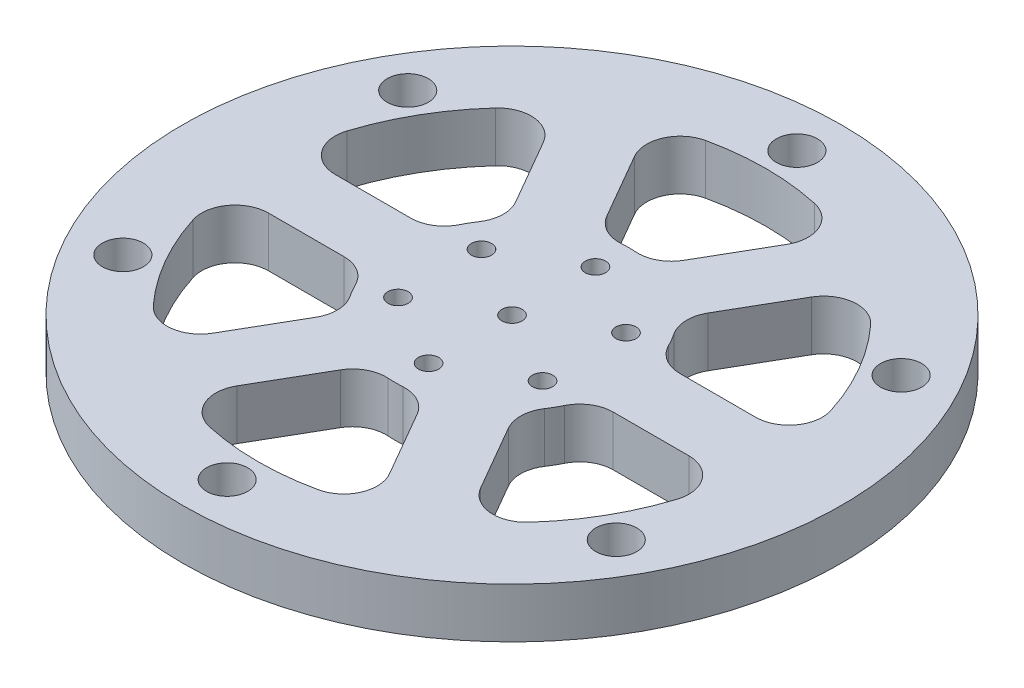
from build123d import *

# Parameters (mm, degrees)
SKETCH1_R          = 31.353125
SKETCH1_R_2        = 0.9652
BASE_EXTRUDE_DEPTH = 4.7625
SKETCH2_R          = 0.9652
SKETCH2_R_2        = 1.9558
CUT_EXTRUDE1_DEPTH = 45.59504794
CIRPATTERN1_COUNT  = 6


with BuildPart() as part:
    # Sketch1 → Base-Extrude (new body)
    with BuildSketch(Plane(origin=(0, 0, 0), x_dir=(1, 0, 0), z_dir=(0, 1, 0))):
        with Locations(Location((0, 0, 0), (0, 0, 90))):
            Circle(SKETCH1_R)
        with Locations(Location((0, 0, 0), (0, 0, 90))):
            Circle(SKETCH1_R_2, mode=Mode.SUBTRACT)
    extrude(amount=BASE_EXTRUDE_DEPTH)

    # Sketch2 → Cut-Extrude1 (cut, through all)
    with BuildSketch(Plane(origin=(0, 4.7625, 0), x_dir=(-1, 0, 0), z_dir=(0, 1, 0))):
        with Locations(Location((6.874076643, 3.96875, 0), (0, 0, 90))):
            Circle(SKETCH2_R)
        with Locations(Location((23.470847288, 13.5509, 0), (0, 0, 90))):
            Circle(SKETCH2_R_2)
        with BuildLine():
            Line((9.149047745, 9.496615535), (12.749766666, 15.733243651))
            ThreePointArc((12.749766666, 15.733243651), (15.156896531, 17.302216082), (17.844531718, 16.286063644))
            ThreePointArc((17.844531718, 16.286063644), (20.922413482, 12.079561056), (23.026410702, 7.310785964))
            ThreePointArc((23.026410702, 7.310785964), (22.562606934, 4.475149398), (20.000272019, 3.175))
            Line((20.000272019, 3.175), (12.798834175, 3.175))
            ThreePointArc((12.798834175, 3.175), (11.125462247, 3.651768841), (9.954648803, 4.938888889))
            ThreePointArc((9.954648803, 4.938888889), (9.6237073, 5.55625), (9.254527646, 6.151534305))
            ThreePointArc((9.254527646, 6.151534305), (8.725255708, 7.809048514), (9.149047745, 9.496615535))
        make_face()
    cut_extrude1 = extrude(amount=-CUT_EXTRUDE1_DEPTH, mode=Mode.SUBTRACT)

    # CirPattern1: Cut-Extrude1 ×6 about axis
    cirpattern1_axis = Axis((0, 0, 0), (0, 1, 0))
    for i in range(1, CIRPATTERN1_COUNT):
        add(cut_extrude1.rotate(cirpattern1_axis, i * 360 / CIRPATTERN1_COUNT), mode=Mode.SUBTRACT)


solid = part.part
